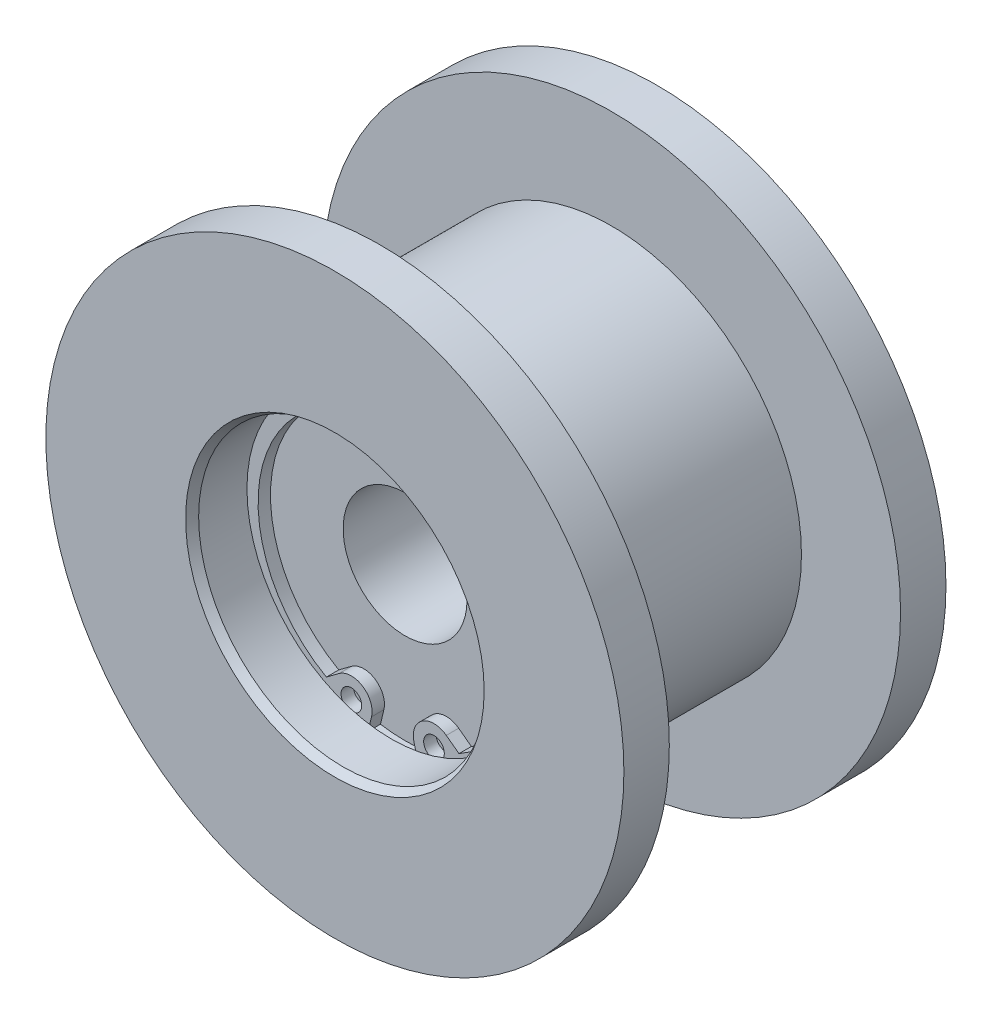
ISO-10303-21;
HEADER;
FILE_DESCRIPTION(('STEP AP214'),'2;1');
FILE_NAME('part.step','',(''),(''),'','','');
FILE_SCHEMA(('AUTOMOTIVE_DESIGN { 1 0 10303 214 1 1 1 1 }'));
ENDSEC;
DATA;
#1=APPLICATION_CONTEXT('core data for automotive mechanical design processes');
#2=APPLICATION_PROTOCOL_DEFINITION('international standard','automotive_design',2000,#1);
#3=PRODUCT_CONTEXT('',#1,'mechanical');
#4=PRODUCT('Part','Part','',(#3));
#5=PRODUCT_RELATED_PRODUCT_CATEGORY('part','',(#4));
#6=PRODUCT_DEFINITION_FORMATION('','',#4);
#7=PRODUCT_DEFINITION_CONTEXT('part definition',#1,'design');
#8=PRODUCT_DEFINITION('design','',#6,#7);
#9=PRODUCT_DEFINITION_SHAPE('','',#8);
#10=(LENGTH_UNIT() NAMED_UNIT(*) SI_UNIT(.MILLI.,.METRE.));
#11=(NAMED_UNIT(*) PLANE_ANGLE_UNIT() SI_UNIT($,.RADIAN.));
#12=(NAMED_UNIT(*) SI_UNIT($,.STERADIAN.) SOLID_ANGLE_UNIT());
#13=UNCERTAINTY_MEASURE_WITH_UNIT(LENGTH_MEASURE(1.E-05),#10,'distance_accuracy_value','');
#14=(GEOMETRIC_REPRESENTATION_CONTEXT(3) GLOBAL_UNCERTAINTY_ASSIGNED_CONTEXT((#13)) GLOBAL_UNIT_ASSIGNED_CONTEXT((#10,
#11,#12)) REPRESENTATION_CONTEXT('',''));
#15=CARTESIAN_POINT('',(0.,0.,0.));
#16=DIRECTION('',(0.,0.,1.));
#17=DIRECTION('',(1.,0.,0.));
#18=AXIS2_PLACEMENT_3D('',#15,#16,#17);
#19=CARTESIAN_POINT('',(0.,-0.9,12.6));
#20=DIRECTION('',(0.,0.,1.));
#21=DIRECTION('',(-1.,0.,0.));
#22=AXIS2_PLACEMENT_3D('',#19,#20,#21);
#23=CYLINDRICAL_SURFACE('',#22,16.3);
#24=CARTESIAN_POINT('',(0.,-0.9,12.5));
#25=DIRECTION('',(0.,0.,1.));
#26=DIRECTION('',(1.,0.,0.));
#27=AXIS2_PLACEMENT_3D('',#24,#25,#26);
#28=CIRCLE('',#27,16.3);
#29=CARTESIAN_POINT('',(-8.02922574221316,-15.0852576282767,12.5));
#30=VERTEX_POINT('',#29);
#31=CARTESIAN_POINT('',(8.02922574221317,-15.0852576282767,12.5));
#32=VERTEX_POINT('',#31);
#33=EDGE_CURVE('E281',#30,#32,#28,.F.);
#34=ORIENTED_EDGE('',*,*,#33,.F.);
#35=DIRECTION('',(0.,0.,-1.));
#36=VECTOR('',#35,1.);
#37=CARTESIAN_POINT('',(-8.02922574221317,-15.0852576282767,12.6));
#38=LINE('',#37,#36);
#39=CARTESIAN_POINT('',(-8.02922574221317,-15.0852576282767,11.));
#40=VERTEX_POINT('',#39);
#41=EDGE_CURVE('E246',#30,#40,#38,.T.);
#42=ORIENTED_EDGE('',*,*,#41,.T.);
#43=CARTESIAN_POINT('',(0.,-0.9,11.));
#44=DIRECTION('',(0.,0.,-1.));
#45=DIRECTION('',(0.,-1.,0.));
#46=AXIS2_PLACEMENT_3D('',#43,#44,#45);
#47=CIRCLE('',#46,16.3);
#48=CARTESIAN_POINT('',(8.02922574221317,-15.0852576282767,11.));
#49=VERTEX_POINT('',#48);
#50=EDGE_CURVE('E232',#40,#49,#47,.T.);
#51=ORIENTED_EDGE('',*,*,#50,.T.);
#52=DIRECTION('',(0.,0.,-1.));
#53=VECTOR('',#52,1.);
#54=CARTESIAN_POINT('',(8.02922574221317,-15.0852576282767,12.6));
#55=LINE('',#54,#53);
#56=EDGE_CURVE('E247',#32,#49,#55,.T.);
#57=ORIENTED_EDGE('',*,*,#56,.F.);
#58=EDGE_LOOP('',(#34,#42,#51,#57));
#59=FACE_BOUND('',#58,.T.);
#60=ADVANCED_FACE('F14',(#59),#23,.F.);
#61=CARTESIAN_POINT('',(6.49138441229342,-13.9421779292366,12.6));
#62=DIRECTION('',(-0.596553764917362,-0.802573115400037,0.));
#63=DIRECTION('',(-0.802573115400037,0.596553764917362,0.));
#64=AXIS2_PLACEMENT_3D('',#61,#62,#63);
#65=PLANE('',#64);
#66=DIRECTION('',(-0.802573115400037,0.596553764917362,0.));
#67=VECTOR('',#66,1.);
#68=CARTESIAN_POINT('',(6.49138441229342,-13.9421779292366,12.5));
#69=LINE('',#68,#67);
#70=CARTESIAN_POINT('',(6.49138441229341,-13.9421779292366,12.5));
#71=VERTEX_POINT('',#70);
#72=EDGE_CURVE('E283',#32,#71,#69,.T.);
#73=ORIENTED_EDGE('',*,*,#72,.F.);
#74=ORIENTED_EDGE('',*,*,#56,.T.);
#75=DIRECTION('',(-0.802573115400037,0.596553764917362,0.));
#76=VECTOR('',#75,1.);
#77=CARTESIAN_POINT('',(6.49138441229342,-13.9421779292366,11.));
#78=LINE('',#77,#76);
#79=CARTESIAN_POINT('',(6.49138441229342,-13.9421779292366,11.));
#80=VERTEX_POINT('',#79);
#81=EDGE_CURVE('E243',#49,#80,#78,.T.);
#82=ORIENTED_EDGE('',*,*,#81,.T.);
#83=DIRECTION('',(0.,0.,-1.));
#84=VECTOR('',#83,1.);
#85=CARTESIAN_POINT('',(6.49138441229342,-13.9421779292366,12.6));
#86=LINE('',#85,#84);
#87=EDGE_CURVE('E263',#71,#80,#86,.T.);
#88=ORIENTED_EDGE('',*,*,#87,.F.);
#89=EDGE_LOOP('',(#73,#74,#82,#88));
#90=FACE_BOUND('',#89,.T.);
#91=ADVANCED_FACE('F181',(#90),#65,.F.);
#92=CARTESIAN_POINT('',(5.,-15.9486107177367,12.6));
#93=DIRECTION('',(0.,0.,1.));
#94=DIRECTION('',(-1.,0.,0.));
#95=AXIS2_PLACEMENT_3D('',#92,#93,#94);
#96=CYLINDRICAL_SURFACE('',#95,2.5);
#97=DIRECTION('',(0.,0.,-1.));
#98=VECTOR('',#97,1.);
#99=CARTESIAN_POINT('',(2.5678231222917,-16.526983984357,12.6));
#100=LINE('',#99,#98);
#101=CARTESIAN_POINT('',(2.5678231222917,-16.526983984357,12.5));
#102=VERTEX_POINT('',#101);
#103=CARTESIAN_POINT('',(2.5678231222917,-16.526983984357,11.));
#104=VERTEX_POINT('',#103);
#105=EDGE_CURVE('E238',#102,#104,#100,.T.);
#106=ORIENTED_EDGE('',*,*,#105,.F.);
#107=CARTESIAN_POINT('',(5.,-15.9486107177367,12.5));
#108=DIRECTION('',(0.,0.,1.));
#109=DIRECTION('',(1.,0.,0.));
#110=AXIS2_PLACEMENT_3D('',#107,#108,#109);
#111=CIRCLE('',#110,2.5);
#112=EDGE_CURVE('E285',#102,#71,#111,.F.);
#113=ORIENTED_EDGE('',*,*,#112,.T.);
#114=ORIENTED_EDGE('',*,*,#87,.T.);
#115=CARTESIAN_POINT('',(5.,-15.9486107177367,11.));
#116=DIRECTION('',(0.,0.,1.));
#117=DIRECTION('',(1.,0.,0.));
#118=AXIS2_PLACEMENT_3D('',#115,#116,#117);
#119=CIRCLE('',#118,2.5);
#120=EDGE_CURVE('E113',#80,#104,#119,.T.);
#121=ORIENTED_EDGE('',*,*,#120,.T.);
#122=EDGE_LOOP('',(#106,#113,#114,#121));
#123=FACE_BOUND('',#122,.T.);
#124=ADVANCED_FACE('F187',(#123),#96,.T.);
#125=CARTESIAN_POINT('',(-2.56782312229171,-16.526983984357,12.6));
#126=DIRECTION('',(-0.97287075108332,0.231349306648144,0.));
#127=DIRECTION('',(0.,0.,1.));
#128=AXIS2_PLACEMENT_3D('',#125,#126,#127);
#129=PLANE('',#128);
#130=DIRECTION('',(0.231349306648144,0.97287075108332,0.));
#131=VECTOR('',#130,1.);
#132=CARTESIAN_POINT('',(-2.56782312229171,-16.526983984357,12.5));
#133=LINE('',#132,#131);
#134=CARTESIAN_POINT('',(-2.97957431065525,-18.2584812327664,12.5));
#135=VERTEX_POINT('',#134);
#136=CARTESIAN_POINT('',(-2.5678231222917,-16.526983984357,12.5));
#137=VERTEX_POINT('',#136);
#138=EDGE_CURVE('E89',#135,#137,#133,.T.);
#139=ORIENTED_EDGE('',*,*,#138,.F.);
#140=DIRECTION('',(0.,0.,1.));
#141=VECTOR('',#140,1.);
#142=CARTESIAN_POINT('',(-2.97957431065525,-18.2584812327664,12.1183293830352));
#143=LINE('',#142,#141);
#144=CARTESIAN_POINT('',(-2.97957431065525,-18.2584812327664,11.));
#145=VERTEX_POINT('',#144);
#146=EDGE_CURVE('E22',#145,#135,#143,.T.);
#147=ORIENTED_EDGE('',*,*,#146,.F.);
#148=DIRECTION('',(0.231349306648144,0.97287075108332,0.));
#149=VECTOR('',#148,1.);
#150=CARTESIAN_POINT('',(-2.56782312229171,-16.526983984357,11.));
#151=LINE('',#150,#149);
#152=CARTESIAN_POINT('',(-2.56782312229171,-16.526983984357,11.));
#153=VERTEX_POINT('',#152);
#154=EDGE_CURVE('E35',#145,#153,#151,.T.);
#155=ORIENTED_EDGE('',*,*,#154,.T.);
#156=DIRECTION('',(0.,0.,-1.));
#157=VECTOR('',#156,1.);
#158=CARTESIAN_POINT('',(-2.56782312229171,-16.526983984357,12.6));
#159=LINE('',#158,#157);
#160=EDGE_CURVE('E98',#137,#153,#159,.T.);
#161=ORIENTED_EDGE('',*,*,#160,.F.);
#162=EDGE_LOOP('',(#139,#147,#155,#161));
#163=FACE_BOUND('',#162,.T.);
#164=ADVANCED_FACE('F97',(#163),#129,.F.);
#165=CARTESIAN_POINT('',(-6.49138441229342,-13.9421779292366,12.6));
#166=DIRECTION('',(0.596553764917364,-0.802573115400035,0.));
#167=DIRECTION('',(0.,0.,-1.));
#168=AXIS2_PLACEMENT_3D('',#165,#166,#167);
#169=PLANE('',#168);
#170=DIRECTION('',(-0.802573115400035,-0.596553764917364,0.));
#171=VECTOR('',#170,1.);
#172=CARTESIAN_POINT('',(-6.49138441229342,-13.9421779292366,12.5));
#173=LINE('',#172,#171);
#174=CARTESIAN_POINT('',(-6.49138441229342,-13.9421779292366,12.5));
#175=VERTEX_POINT('',#174);
#176=EDGE_CURVE('E279',#175,#30,#173,.T.);
#177=ORIENTED_EDGE('',*,*,#176,.F.);
#178=DIRECTION('',(0.,0.,-1.));
#179=VECTOR('',#178,1.);
#180=CARTESIAN_POINT('',(-6.49138441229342,-13.9421779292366,12.6));
#181=LINE('',#180,#179);
#182=CARTESIAN_POINT('',(-6.49138441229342,-13.9421779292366,11.));
#183=VERTEX_POINT('',#182);
#184=EDGE_CURVE('E109',#175,#183,#181,.T.);
#185=ORIENTED_EDGE('',*,*,#184,.T.);
#186=DIRECTION('',(-0.802573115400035,-0.596553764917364,0.));
#187=VECTOR('',#186,1.);
#188=CARTESIAN_POINT('',(-6.49138441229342,-13.9421779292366,11.));
#189=LINE('',#188,#187);
#190=EDGE_CURVE('E105',#183,#40,#189,.T.);
#191=ORIENTED_EDGE('',*,*,#190,.T.);
#192=ORIENTED_EDGE('',*,*,#41,.F.);
#193=EDGE_LOOP('',(#177,#185,#191,#192));
#194=FACE_BOUND('',#193,.T.);
#195=ADVANCED_FACE('F197',(#194),#169,.F.);
#196=CARTESIAN_POINT('',(-5.,-15.9486107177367,12.6));
#197=DIRECTION('',(0.,0.,1.));
#198=DIRECTION('',(-1.,0.,0.));
#199=AXIS2_PLACEMENT_3D('',#196,#197,#198);
#200=CYLINDRICAL_SURFACE('',#199,2.5);
#201=ORIENTED_EDGE('',*,*,#184,.F.);
#202=CARTESIAN_POINT('',(-5.,-15.9486107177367,12.5));
#203=DIRECTION('',(0.,0.,1.));
#204=DIRECTION('',(1.,0.,0.));
#205=AXIS2_PLACEMENT_3D('',#202,#203,#204);
#206=CIRCLE('',#205,2.5);
#207=EDGE_CURVE('E100',#175,#137,#206,.F.);
#208=ORIENTED_EDGE('',*,*,#207,.T.);
#209=ORIENTED_EDGE('',*,*,#160,.T.);
#210=CARTESIAN_POINT('',(-5.,-15.9486107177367,11.));
#211=DIRECTION('',(0.,0.,1.));
#212=DIRECTION('',(-1.,0.,0.));
#213=AXIS2_PLACEMENT_3D('',#210,#211,#212);
#214=CIRCLE('',#213,2.5);
#215=EDGE_CURVE('E220',#153,#183,#214,.T.);
#216=ORIENTED_EDGE('',*,*,#215,.T.);
#217=EDGE_LOOP('',(#201,#208,#209,#216));
#218=FACE_BOUND('',#217,.T.);
#219=ADVANCED_FACE('F204',(#218),#200,.T.);
#220=CARTESIAN_POINT('',(2.5678231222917,-16.526983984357,12.6));
#221=DIRECTION('',(0.972870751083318,0.231349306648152,0.));
#222=DIRECTION('',(0.,0.,-1.));
#223=AXIS2_PLACEMENT_3D('',#220,#221,#222);
#224=PLANE('',#223);
#225=DIRECTION('',(0.231349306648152,-0.972870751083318,0.));
#226=VECTOR('',#225,1.);
#227=CARTESIAN_POINT('',(2.5678231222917,-16.526983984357,12.5));
#228=LINE('',#227,#226);
#229=CARTESIAN_POINT('',(2.97957431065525,-18.2584812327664,12.5));
#230=VERTEX_POINT('',#229);
#231=EDGE_CURVE('E92',#102,#230,#228,.T.);
#232=ORIENTED_EDGE('',*,*,#231,.F.);
#233=ORIENTED_EDGE('',*,*,#105,.T.);
#234=DIRECTION('',(0.231349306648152,-0.972870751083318,0.));
#235=VECTOR('',#234,1.);
#236=CARTESIAN_POINT('',(2.5678231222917,-16.526983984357,11.));
#237=LINE('',#236,#235);
#238=CARTESIAN_POINT('',(2.97957431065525,-18.2584812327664,11.));
#239=VERTEX_POINT('',#238);
#240=EDGE_CURVE('E236',#104,#239,#237,.T.);
#241=ORIENTED_EDGE('',*,*,#240,.T.);
#242=DIRECTION('',(0.,0.,1.));
#243=VECTOR('',#242,1.);
#244=CARTESIAN_POINT('',(2.97957431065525,-18.2584812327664,12.1183293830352));
#245=LINE('',#244,#243);
#246=EDGE_CURVE('E9',#230,#239,#245,.F.);
#247=ORIENTED_EDGE('',*,*,#246,.F.);
#248=EDGE_LOOP('',(#232,#233,#241,#247));
#249=FACE_BOUND('',#248,.T.);
#250=ADVANCED_FACE('F193',(#249),#224,.F.);
#251=CARTESIAN_POINT('',(0.,0.,12.1183293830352));
#252=DIRECTION('',(0.,0.,1.));
#253=DIRECTION('',(1.,0.,0.));
#254=AXIS2_PLACEMENT_3D('',#251,#252,#253);
#255=CYLINDRICAL_SURFACE('',#254,23.);
#256=CARTESIAN_POINT('',(0.,0.,14.));
#257=DIRECTION('',(0.,0.,1.));
#258=DIRECTION('',(1.,0.,0.));
#259=AXIS2_PLACEMENT_3D('',#256,#257,#258);
#260=CIRCLE('',#259,23.);
#261=CARTESIAN_POINT('',(23.,0.,14.));
#262=VERTEX_POINT('',#261);
#263=EDGE_CURVE('E126',#262,#262,#260,.T.);
#264=ORIENTED_EDGE('',*,*,#263,.F.);
#265=EDGE_LOOP('',(#264));
#266=FACE_BOUND('',#265,.T.);
#267=CARTESIAN_POINT('',(0.,0.,-14.));
#268=DIRECTION('',(0.,0.,1.));
#269=DIRECTION('',(1.,0.,0.));
#270=AXIS2_PLACEMENT_3D('',#267,#268,#269);
#271=CIRCLE('',#270,23.);
#272=CARTESIAN_POINT('',(23.,0.,-14.));
#273=VERTEX_POINT('',#272);
#274=EDGE_CURVE('E123',#273,#273,#271,.T.);
#275=ORIENTED_EDGE('',*,*,#274,.T.);
#276=EDGE_LOOP('',(#275));
#277=FACE_BOUND('',#276,.T.);
#278=ADVANCED_FACE('F216',(#266,#277),#255,.T.);
#279=CARTESIAN_POINT('',(0.,23.,14.));
#280=DIRECTION('',(0.,0.,1.));
#281=DIRECTION('',(1.,0.,0.));
#282=AXIS2_PLACEMENT_3D('',#279,#280,#281);
#283=PLANE('',#282);
#284=CARTESIAN_POINT('',(0.,0.,14.));
#285=DIRECTION('',(0.,0.,1.));
#286=DIRECTION('',(1.,0.,0.));
#287=AXIS2_PLACEMENT_3D('',#284,#285,#286);
#288=CIRCLE('',#287,35.);
#289=CARTESIAN_POINT('',(35.,0.,14.));
#290=VERTEX_POINT('',#289);
#291=EDGE_CURVE('E129',#290,#290,#288,.T.);
#292=ORIENTED_EDGE('',*,*,#291,.F.);
#293=EDGE_LOOP('',(#292));
#294=FACE_BOUND('',#293,.T.);
#295=ORIENTED_EDGE('',*,*,#263,.T.);
#296=EDGE_LOOP('',(#295));
#297=FACE_BOUND('',#296,.T.);
#298=ADVANCED_FACE('F400',(#294,#297),#283,.F.);
#299=CARTESIAN_POINT('',(0.,35.,-14.));
#300=DIRECTION('',(0.,0.,-1.));
#301=DIRECTION('',(-1.,0.,0.));
#302=AXIS2_PLACEMENT_3D('',#299,#300,#301);
#303=PLANE('',#302);
#304=ORIENTED_EDGE('',*,*,#274,.F.);
#305=EDGE_LOOP('',(#304));
#306=FACE_BOUND('',#305,.T.);
#307=CARTESIAN_POINT('',(0.,0.,-14.));
#308=DIRECTION('',(0.,0.,1.));
#309=DIRECTION('',(1.,0.,0.));
#310=AXIS2_PLACEMENT_3D('',#307,#308,#309);
#311=CIRCLE('',#310,35.);
#312=CARTESIAN_POINT('',(35.,0.,-14.));
#313=VERTEX_POINT('',#312);
#314=EDGE_CURVE('E120',#313,#313,#311,.T.);
#315=ORIENTED_EDGE('',*,*,#314,.T.);
#316=EDGE_LOOP('',(#315));
#317=FACE_BOUND('',#316,.T.);
#318=ADVANCED_FACE('F409',(#306,#317),#303,.F.);
#319=CARTESIAN_POINT('',(0.,0.,12.1183293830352));
#320=DIRECTION('',(0.,0.,1.));
#321=DIRECTION('',(1.,0.,0.));
#322=AXIS2_PLACEMENT_3D('',#319,#320,#321);
#323=CYLINDRICAL_SURFACE('',#322,35.);
#324=CARTESIAN_POINT('',(0.,0.,19.5));
#325=DIRECTION('',(0.,0.,1.));
#326=DIRECTION('',(1.,0.,0.));
#327=AXIS2_PLACEMENT_3D('',#324,#325,#326);
#328=CIRCLE('',#327,35.);
#329=CARTESIAN_POINT('',(35.,0.,19.5));
#330=VERTEX_POINT('',#329);
#331=EDGE_CURVE('E132',#330,#330,#328,.T.);
#332=ORIENTED_EDGE('',*,*,#331,.F.);
#333=EDGE_LOOP('',(#332));
#334=FACE_BOUND('',#333,.T.);
#335=ORIENTED_EDGE('',*,*,#291,.T.);
#336=EDGE_LOOP('',(#335));
#337=FACE_BOUND('',#336,.T.);
#338=ADVANCED_FACE('F418',(#334,#337),#323,.T.);
#339=CARTESIAN_POINT('',(0.,0.,12.1183293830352));
#340=DIRECTION('',(0.,0.,1.));
#341=DIRECTION('',(1.,0.,0.));
#342=AXIS2_PLACEMENT_3D('',#339,#340,#341);
#343=CYLINDRICAL_SURFACE('',#342,35.);
#344=ORIENTED_EDGE('',*,*,#314,.F.);
#345=EDGE_LOOP('',(#344));
#346=FACE_BOUND('',#345,.T.);
#347=CARTESIAN_POINT('',(0.,0.,-19.5));
#348=DIRECTION('',(0.,0.,1.));
#349=DIRECTION('',(1.,0.,0.));
#350=AXIS2_PLACEMENT_3D('',#347,#348,#349);
#351=CIRCLE('',#350,35.);
#352=CARTESIAN_POINT('',(35.,0.,-19.5));
#353=VERTEX_POINT('',#352);
#354=EDGE_CURVE('E154',#353,#353,#351,.T.);
#355=ORIENTED_EDGE('',*,*,#354,.T.);
#356=EDGE_LOOP('',(#355));
#357=FACE_BOUND('',#356,.T.);
#358=ADVANCED_FACE('F16',(#346,#357),#343,.T.);
#359=CARTESIAN_POINT('',(0.,35.,19.5));
#360=DIRECTION('',(0.,0.,-1.));
#361=DIRECTION('',(-1.,0.,0.));
#362=AXIS2_PLACEMENT_3D('',#359,#360,#361);
#363=PLANE('',#362);
#364=CARTESIAN_POINT('',(0.,0.,19.5));
#365=DIRECTION('',(0.,0.,1.));
#366=DIRECTION('',(1.,0.,0.));
#367=AXIS2_PLACEMENT_3D('',#364,#365,#366);
#368=CIRCLE('',#367,18.0773502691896);
#369=CARTESIAN_POINT('',(18.0773502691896,0.,19.5));
#370=VERTEX_POINT('',#369);
#371=EDGE_CURVE('E135',#370,#370,#368,.T.);
#372=ORIENTED_EDGE('',*,*,#371,.F.);
#373=EDGE_LOOP('',(#372));
#374=FACE_BOUND('',#373,.T.);
#375=ORIENTED_EDGE('',*,*,#331,.T.);
#376=EDGE_LOOP('',(#375));
#377=FACE_BOUND('',#376,.T.);
#378=ADVANCED_FACE('F434',(#374,#377),#363,.F.);
#379=CARTESIAN_POINT('',(0.,14.5,-19.5));
#380=DIRECTION('',(0.,0.,1.));
#381=DIRECTION('',(1.,0.,0.));
#382=AXIS2_PLACEMENT_3D('',#379,#380,#381);
#383=PLANE('',#382);
#384=ORIENTED_EDGE('',*,*,#354,.F.);
#385=EDGE_LOOP('',(#384));
#386=FACE_BOUND('',#385,.T.);
#387=CARTESIAN_POINT('',(0.,0.,-19.5));
#388=DIRECTION('',(0.,0.,1.));
#389=DIRECTION('',(1.,0.,0.));
#390=AXIS2_PLACEMENT_3D('',#387,#388,#389);
#391=CIRCLE('',#390,14.5);
#392=CARTESIAN_POINT('',(14.5,0.,-19.5));
#393=VERTEX_POINT('',#392);
#394=EDGE_CURVE('E151',#393,#393,#391,.T.);
#395=ORIENTED_EDGE('',*,*,#394,.T.);
#396=EDGE_LOOP('',(#395));
#397=FACE_BOUND('',#396,.T.);
#398=ADVANCED_FACE('F442',(#386,#397),#383,.F.);
#399=CARTESIAN_POINT('',(0.,0.,19.5));
#400=DIRECTION('',(0.,0.,1.));
#401=DIRECTION('',(1.,0.,0.));
#402=AXIS2_PLACEMENT_3D('',#399,#400,#401);
#403=CONICAL_SURFACE('',#402,18.0773502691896,0.523598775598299);
#404=CARTESIAN_POINT('',(0.,0.,18.5));
#405=DIRECTION('',(0.,0.,1.));
#406=DIRECTION('',(1.,0.,0.));
#407=AXIS2_PLACEMENT_3D('',#404,#405,#406);
#408=CIRCLE('',#407,17.5);
#409=CARTESIAN_POINT('',(17.5,0.,18.5));
#410=VERTEX_POINT('',#409);
#411=EDGE_CURVE('E138',#410,#410,#408,.T.);
#412=ORIENTED_EDGE('',*,*,#411,.F.);
#413=EDGE_LOOP('',(#412));
#414=FACE_BOUND('',#413,.T.);
#415=ORIENTED_EDGE('',*,*,#371,.T.);
#416=EDGE_LOOP('',(#415));
#417=FACE_BOUND('',#416,.T.);
#418=ADVANCED_FACE('F451',(#414,#417),#403,.F.);
#419=CARTESIAN_POINT('',(0.,0.,12.1183293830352));
#420=DIRECTION('',(0.,0.,1.));
#421=DIRECTION('',(1.,0.,0.));
#422=AXIS2_PLACEMENT_3D('',#419,#420,#421);
#423=CYLINDRICAL_SURFACE('',#422,14.5);
#424=ORIENTED_EDGE('',*,*,#394,.F.);
#425=EDGE_LOOP('',(#424));
#426=FACE_BOUND('',#425,.T.);
#427=CARTESIAN_POINT('',(0.,0.,-11.));
#428=DIRECTION('',(0.,0.,1.));
#429=DIRECTION('',(1.,0.,0.));
#430=AXIS2_PLACEMENT_3D('',#427,#428,#429);
#431=CIRCLE('',#430,14.5);
#432=CARTESIAN_POINT('',(14.5,0.,-11.));
#433=VERTEX_POINT('',#432);
#434=EDGE_CURVE('E148',#433,#433,#431,.T.);
#435=ORIENTED_EDGE('',*,*,#434,.T.);
#436=EDGE_LOOP('',(#435));
#437=FACE_BOUND('',#436,.T.);
#438=ADVANCED_FACE('F459',(#426,#437),#423,.F.);
#439=CARTESIAN_POINT('',(0.,0.,12.1183293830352));
#440=DIRECTION('',(0.,0.,1.));
#441=DIRECTION('',(1.,0.,0.));
#442=AXIS2_PLACEMENT_3D('',#439,#440,#441);
#443=CYLINDRICAL_SURFACE('',#442,17.5);
#444=CARTESIAN_POINT('',(0.,0.,12.65));
#445=DIRECTION('',(0.,0.,1.));
#446=DIRECTION('',(1.,0.,0.));
#447=AXIS2_PLACEMENT_3D('',#444,#445,#446);
#448=CIRCLE('',#447,17.5);
#449=CARTESIAN_POINT('',(17.5,0.,12.65));
#450=VERTEX_POINT('',#449);
#451=EDGE_CURVE('E118',#450,#450,#448,.F.);
#452=ORIENTED_EDGE('',*,*,#451,.T.);
#453=EDGE_LOOP('',(#452));
#454=FACE_BOUND('',#453,.T.);
#455=ORIENTED_EDGE('',*,*,#411,.T.);
#456=EDGE_LOOP('',(#455));
#457=FACE_BOUND('',#456,.T.);
#458=ADVANCED_FACE('F160',(#454,#457),#443,.F.);
#459=CARTESIAN_POINT('',(0.,14.5,-11.));
#460=DIRECTION('',(0.,0.,1.));
#461=DIRECTION('',(1.,0.,0.));
#462=AXIS2_PLACEMENT_3D('',#459,#460,#461);
#463=PLANE('',#462);
#464=ORIENTED_EDGE('',*,*,#434,.F.);
#465=EDGE_LOOP('',(#464));
#466=FACE_BOUND('',#465,.T.);
#467=CARTESIAN_POINT('',(0.,0.,-11.));
#468=DIRECTION('',(0.,0.,1.));
#469=DIRECTION('',(1.,0.,0.));
#470=AXIS2_PLACEMENT_3D('',#467,#468,#469);
#471=CIRCLE('',#470,7.5);
#472=CARTESIAN_POINT('',(7.5,0.,-11.));
#473=VERTEX_POINT('',#472);
#474=EDGE_CURVE('E145',#473,#473,#471,.T.);
#475=ORIENTED_EDGE('',*,*,#474,.T.);
#476=EDGE_LOOP('',(#475));
#477=FACE_BOUND('',#476,.T.);
#478=ADVANCED_FACE('F165',(#466,#477),#463,.F.);
#479=CARTESIAN_POINT('',(0.,0.,12.65));
#480=DIRECTION('',(0.,0.,1.));
#481=DIRECTION('',(1.,0.,0.));
#482=AXIS2_PLACEMENT_3D('',#479,#480,#481);
#483=PLANE('',#482);
#484=CARTESIAN_POINT('',(0.,0.,12.65));
#485=DIRECTION('',(0.,0.,1.));
#486=DIRECTION('',(1.,0.,0.));
#487=AXIS2_PLACEMENT_3D('',#484,#485,#486);
#488=CIRCLE('',#487,18.5);
#489=CARTESIAN_POINT('',(18.5,0.,12.65));
#490=VERTEX_POINT('',#489);
#491=EDGE_CURVE('E115',#490,#490,#488,.T.);
#492=ORIENTED_EDGE('',*,*,#491,.F.);
#493=EDGE_LOOP('',(#492));
#494=FACE_BOUND('',#493,.T.);
#495=ORIENTED_EDGE('',*,*,#451,.F.);
#496=EDGE_LOOP('',(#495));
#497=FACE_BOUND('',#496,.T.);
#498=ADVANCED_FACE('F163',(#494,#497),#483,.F.);
#499=CARTESIAN_POINT('',(0.,0.,12.1183293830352));
#500=DIRECTION('',(0.,0.,1.));
#501=DIRECTION('',(1.,0.,0.));
#502=AXIS2_PLACEMENT_3D('',#499,#500,#501);
#503=CYLINDRICAL_SURFACE('',#502,18.5);
#504=CARTESIAN_POINT('',(0.,0.,12.5));
#505=DIRECTION('',(0.,0.,1.));
#506=DIRECTION('',(1.,0.,0.));
#507=AXIS2_PLACEMENT_3D('',#504,#505,#506);
#508=CIRCLE('',#507,18.5);
#509=EDGE_CURVE('E85',#230,#135,#508,.T.);
#510=ORIENTED_EDGE('',*,*,#509,.F.);
#511=ORIENTED_EDGE('',*,*,#246,.T.);
#512=CARTESIAN_POINT('',(0.,0.,11.));
#513=DIRECTION('',(0.,0.,1.));
#514=DIRECTION('',(1.,0.,0.));
#515=AXIS2_PLACEMENT_3D('',#512,#513,#514);
#516=CIRCLE('',#515,18.5);
#517=EDGE_CURVE('E104',#145,#239,#516,.T.);
#518=ORIENTED_EDGE('',*,*,#517,.F.);
#519=ORIENTED_EDGE('',*,*,#146,.T.);
#520=EDGE_LOOP('',(#510,#511,#518,#519));
#521=FACE_BOUND('',#520,.T.);
#522=ORIENTED_EDGE('',*,*,#491,.T.);
#523=EDGE_LOOP('',(#522));
#524=FACE_BOUND('',#523,.T.);
#525=ADVANCED_FACE('F102',(#521,#524),#503,.F.);
#526=CARTESIAN_POINT('',(0.,0.,12.1183293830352));
#527=DIRECTION('',(0.,0.,1.));
#528=DIRECTION('',(1.,0.,0.));
#529=AXIS2_PLACEMENT_3D('',#526,#527,#528);
#530=CYLINDRICAL_SURFACE('',#529,7.5);
#531=ORIENTED_EDGE('',*,*,#474,.F.);
#532=EDGE_LOOP('',(#531));
#533=FACE_BOUND('',#532,.T.);
#534=CARTESIAN_POINT('',(0.,0.,11.));
#535=DIRECTION('',(0.,0.,1.));
#536=DIRECTION('',(1.,0.,0.));
#537=AXIS2_PLACEMENT_3D('',#534,#535,#536);
#538=CIRCLE('',#537,7.5);
#539=CARTESIAN_POINT('',(7.5,0.,11.));
#540=VERTEX_POINT('',#539);
#541=EDGE_CURVE('E142',#540,#540,#538,.T.);
#542=ORIENTED_EDGE('',*,*,#541,.T.);
#543=EDGE_LOOP('',(#542));
#544=FACE_BOUND('',#543,.T.);
#545=ADVANCED_FACE('F173',(#533,#544),#530,.F.);
#546=CARTESIAN_POINT('',(0.,7.5,11.));
#547=DIRECTION('',(0.,0.,-1.));
#548=DIRECTION('',(-1.,0.,0.));
#549=AXIS2_PLACEMENT_3D('',#546,#547,#548);
#550=PLANE('',#549);
#551=ORIENTED_EDGE('',*,*,#541,.F.);
#552=EDGE_LOOP('',(#551));
#553=FACE_BOUND('',#552,.T.);
#554=ORIENTED_EDGE('',*,*,#517,.T.);
#555=ORIENTED_EDGE('',*,*,#240,.F.);
#556=ORIENTED_EDGE('',*,*,#120,.F.);
#557=ORIENTED_EDGE('',*,*,#81,.F.);
#558=ORIENTED_EDGE('',*,*,#50,.F.);
#559=ORIENTED_EDGE('',*,*,#190,.F.);
#560=ORIENTED_EDGE('',*,*,#215,.F.);
#561=ORIENTED_EDGE('',*,*,#154,.F.);
#562=EDGE_LOOP('',(#554,#555,#556,#557,#558,#559,#560,#561));
#563=FACE_BOUND('',#562,.T.);
#564=ADVANCED_FACE('F292',(#553,#563),#550,.F.);
#565=CARTESIAN_POINT('',(0.,0.,12.5));
#566=DIRECTION('',(0.,0.,1.));
#567=DIRECTION('',(1.,0.,0.));
#568=AXIS2_PLACEMENT_3D('',#565,#566,#567);
#569=PLANE('',#568);
#570=ORIENTED_EDGE('',*,*,#138,.T.);
#571=ORIENTED_EDGE('',*,*,#207,.F.);
#572=ORIENTED_EDGE('',*,*,#176,.T.);
#573=ORIENTED_EDGE('',*,*,#33,.T.);
#574=ORIENTED_EDGE('',*,*,#72,.T.);
#575=ORIENTED_EDGE('',*,*,#112,.F.);
#576=ORIENTED_EDGE('',*,*,#231,.T.);
#577=ORIENTED_EDGE('',*,*,#509,.T.);
#578=EDGE_LOOP('',(#570,#571,#572,#573,#574,#575,#576,#577));
#579=FACE_BOUND('',#578,.T.);
#580=CARTESIAN_POINT('',(-5.,-15.9486107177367,12.5));
#581=DIRECTION('',(0.,0.,1.));
#582=DIRECTION('',(1.,0.,0.));
#583=AXIS2_PLACEMENT_3D('',#580,#581,#582);
#584=CIRCLE('',#583,1.25);
#585=CARTESIAN_POINT('',(-3.75,-15.9486107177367,12.5));
#586=VERTEX_POINT('',#585);
#587=EDGE_CURVE('E99',#586,#586,#584,.F.);
#588=ORIENTED_EDGE('',*,*,#587,.T.);
#589=EDGE_LOOP('',(#588));
#590=FACE_BOUND('',#589,.T.);
#591=CARTESIAN_POINT('',(5.,-15.9486107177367,12.5));
#592=DIRECTION('',(0.,0.,1.));
#593=DIRECTION('',(1.,0.,0.));
#594=AXIS2_PLACEMENT_3D('',#591,#592,#593);
#595=CIRCLE('',#594,1.25);
#596=CARTESIAN_POINT('',(6.25,-15.9486107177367,12.5));
#597=VERTEX_POINT('',#596);
#598=EDGE_CURVE('E119',#597,#597,#595,.F.);
#599=ORIENTED_EDGE('',*,*,#598,.T.);
#600=EDGE_LOOP('',(#599));
#601=FACE_BOUND('',#600,.T.);
#602=ADVANCED_FACE('F87',(#579,#590,#601),#569,.T.);
#603=CARTESIAN_POINT('',(-5.,-15.9486107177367,11.));
#604=DIRECTION('',(0.,0.,-1.));
#605=DIRECTION('',(1.,0.,0.));
#606=AXIS2_PLACEMENT_3D('',#603,#604,#605);
#607=CIRCLE('',#606,1.25);
#608=CARTESIAN_POINT('',(-3.75,-15.9486107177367,11.));
#609=VERTEX_POINT('',#608);
#610=EDGE_CURVE('E156',#609,#609,#607,.T.);
#611=ORIENTED_EDGE('',*,*,#610,.F.);
#612=EDGE_LOOP('',(#611));
#613=FACE_BOUND('',#612,.T.);
#614=ADVANCED_FACE('F209',(#613),#550,.F.);
#615=CARTESIAN_POINT('',(-5.,-15.9486107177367,12.6));
#616=DIRECTION('',(0.,0.,1.));
#617=DIRECTION('',(-1.,0.,0.));
#618=AXIS2_PLACEMENT_3D('',#615,#616,#617);
#619=CYLINDRICAL_SURFACE('',#618,1.25);
#620=ORIENTED_EDGE('',*,*,#610,.T.);
#621=EDGE_LOOP('',(#620));
#622=FACE_BOUND('',#621,.T.);
#623=ORIENTED_EDGE('',*,*,#587,.F.);
#624=EDGE_LOOP('',(#623));
#625=FACE_BOUND('',#624,.T.);
#626=ADVANCED_FACE('F207',(#622,#625),#619,.F.);
#627=CARTESIAN_POINT('',(5.,-15.9486107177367,11.));
#628=DIRECTION('',(0.,0.,1.));
#629=DIRECTION('',(1.,0.,0.));
#630=AXIS2_PLACEMENT_3D('',#627,#628,#629);
#631=CIRCLE('',#630,1.25);
#632=CARTESIAN_POINT('',(6.25,-15.9486107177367,11.));
#633=VERTEX_POINT('',#632);
#634=EDGE_CURVE('E224',#633,#633,#631,.T.);
#635=ORIENTED_EDGE('',*,*,#634,.T.);
#636=EDGE_LOOP('',(#635));
#637=FACE_BOUND('',#636,.T.);
#638=ADVANCED_FACE('F201',(#637),#550,.F.);
#639=CARTESIAN_POINT('',(5.,-15.9486107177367,12.6));
#640=DIRECTION('',(0.,0.,1.));
#641=DIRECTION('',(-1.,0.,0.));
#642=AXIS2_PLACEMENT_3D('',#639,#640,#641);
#643=CYLINDRICAL_SURFACE('',#642,1.25);
#644=ORIENTED_EDGE('',*,*,#634,.F.);
#645=EDGE_LOOP('',(#644));
#646=FACE_BOUND('',#645,.T.);
#647=ORIENTED_EDGE('',*,*,#598,.F.);
#648=EDGE_LOOP('',(#647));
#649=FACE_BOUND('',#648,.T.);
#650=ADVANCED_FACE('F198',(#646,#649),#643,.F.);
#651=CLOSED_SHELL('',(#60,#91,#124,#164,#195,#219,#250,#278,#298,#318,#338,#358,#378,#398,#418,
#438,#458,#478,#498,#525,#545,#564,#602,#614,#626,#638,#650));
#652=MANIFOLD_SOLID_BREP('B1',#651);
#653=ADVANCED_BREP_SHAPE_REPRESENTATION('',(#18,#652),#14);
#654=SHAPE_DEFINITION_REPRESENTATION(#9,#653);
ENDSEC;
END-ISO-10303-21;
